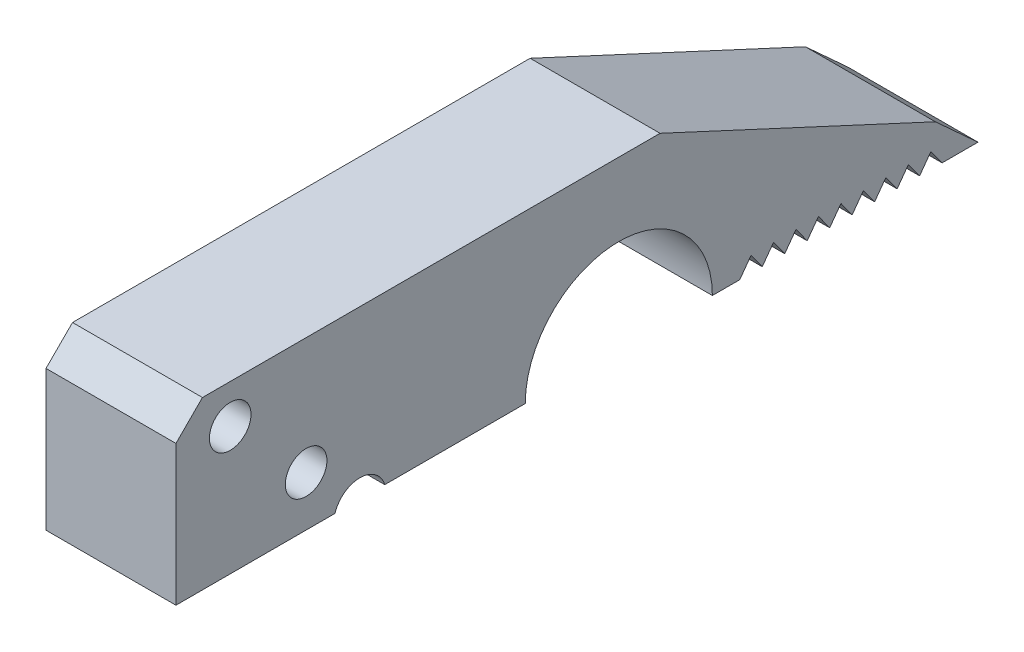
ISO-10303-21;
HEADER;
FILE_DESCRIPTION(('STEP AP214'),'2;1');
FILE_NAME('part.step','',(''),(''),'','','');
FILE_SCHEMA(('AUTOMOTIVE_DESIGN { 1 0 10303 214 1 1 1 1 }'));
ENDSEC;
DATA;
#1=APPLICATION_CONTEXT('core data for automotive mechanical design processes');
#2=APPLICATION_PROTOCOL_DEFINITION('international standard','automotive_design',2000,#1);
#3=PRODUCT_CONTEXT('',#1,'mechanical');
#4=PRODUCT('Part','Part','',(#3));
#5=PRODUCT_RELATED_PRODUCT_CATEGORY('part','',(#4));
#6=PRODUCT_DEFINITION_FORMATION('','',#4);
#7=PRODUCT_DEFINITION_CONTEXT('part definition',#1,'design');
#8=PRODUCT_DEFINITION('design','',#6,#7);
#9=PRODUCT_DEFINITION_SHAPE('','',#8);
#10=(LENGTH_UNIT() NAMED_UNIT(*) SI_UNIT(.MILLI.,.METRE.));
#11=(NAMED_UNIT(*) PLANE_ANGLE_UNIT() SI_UNIT($,.RADIAN.));
#12=(NAMED_UNIT(*) SI_UNIT($,.STERADIAN.) SOLID_ANGLE_UNIT());
#13=UNCERTAINTY_MEASURE_WITH_UNIT(LENGTH_MEASURE(1.E-05),#10,'distance_accuracy_value','');
#14=(GEOMETRIC_REPRESENTATION_CONTEXT(3) GLOBAL_UNCERTAINTY_ASSIGNED_CONTEXT((#13)) GLOBAL_UNIT_ASSIGNED_CONTEXT((#10,
#11,#12)) REPRESENTATION_CONTEXT('',''));
#15=CARTESIAN_POINT('',(0.,0.,0.));
#16=DIRECTION('',(0.,0.,1.));
#17=DIRECTION('',(1.,0.,0.));
#18=AXIS2_PLACEMENT_3D('',#15,#16,#17);
#19=CARTESIAN_POINT('',(10.,-1.98943737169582,-3.36560939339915));
#20=DIRECTION('',(-1.,0.,0.));
#21=DIRECTION('',(0.,0.,1.));
#22=AXIS2_PLACEMENT_3D('',#19,#20,#21);
#23=PLANE('',#22);
#24=DIRECTION('',(0.,0.,-1.));
#25=VECTOR('',#24,1.);
#26=CARTESIAN_POINT('',(10.,-1.40674556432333,10.7902319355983));
#27=LINE('',#26,#25);
#28=CARTESIAN_POINT('',(10.,-1.40674556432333,10.7902319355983));
#29=VERTEX_POINT('',#28);
#30=CARTESIAN_POINT('',(10.,-1.40674556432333,-1.45237384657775));
#31=VERTEX_POINT('',#30);
#32=EDGE_CURVE('E323',#29,#31,#27,.T.);
#33=ORIENTED_EDGE('',*,*,#32,.T.);
#34=CARTESIAN_POINT('',(10.,-1.98943737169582,-3.36560939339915));
#35=DIRECTION('',(-1.,0.,0.));
#36=DIRECTION('',(0.,0.,1.));
#37=AXIS2_PLACEMENT_3D('',#34,#35,#36);
#38=CIRCLE('',#37,2.);
#39=CARTESIAN_POINT('',(10.,-1.40674556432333,-5.27884494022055));
#40=VERTEX_POINT('',#39);
#41=EDGE_CURVE('E166',#31,#40,#38,.T.);
#42=ORIENTED_EDGE('',*,*,#41,.T.);
#43=DIRECTION('',(0.,0.,-1.));
#44=VECTOR('',#43,1.);
#45=CARTESIAN_POINT('',(10.,-1.40674556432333,-5.27884494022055));
#46=LINE('',#45,#44);
#47=CARTESIAN_POINT('',(10.,-1.40674556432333,-16.0922624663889));
#48=VERTEX_POINT('',#47);
#49=EDGE_CURVE('E401',#40,#48,#46,.T.);
#50=ORIENTED_EDGE('',*,*,#49,.T.);
#51=CARTESIAN_POINT('',(10.,-1.40674556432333,-23.2922624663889));
#52=DIRECTION('',(-1.,0.,0.));
#53=DIRECTION('',(0.,0.,1.));
#54=AXIS2_PLACEMENT_3D('',#51,#52,#53);
#55=CIRCLE('',#54,7.2);
#56=CARTESIAN_POINT('',(10.,-1.40674556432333,-30.4922624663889));
#57=VERTEX_POINT('',#56);
#58=EDGE_CURVE('E420',#48,#57,#55,.T.);
#59=ORIENTED_EDGE('',*,*,#58,.T.);
#60=DIRECTION('',(0.,0.,-1.));
#61=VECTOR('',#60,1.);
#62=CARTESIAN_POINT('',(10.,-1.40674556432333,-30.4922624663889));
#63=LINE('',#62,#61);
#64=CARTESIAN_POINT('',(10.,-1.40674556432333,-32.6011015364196));
#65=VERTEX_POINT('',#64);
#66=EDGE_CURVE('E417',#57,#65,#63,.T.);
#67=ORIENTED_EDGE('',*,*,#66,.T.);
#68=DIRECTION('',(0.,0.809016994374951,-0.587785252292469));
#69=VECTOR('',#68,1.);
#70=CARTESIAN_POINT('',(10.,-1.40674556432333,-32.6011015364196));
#71=LINE('',#70,#69);
#72=CARTESIAN_POINT('',(10.,-0.216175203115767,-33.4661015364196));
#73=VERTEX_POINT('',#72);
#74=EDGE_CURVE('E419',#65,#73,#71,.T.);
#75=ORIENTED_EDGE('',*,*,#74,.T.);
#76=DIRECTION('',(0.,-0.809016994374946,-0.587785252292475));
#77=VECTOR('',#76,1.);
#78=CARTESIAN_POINT('',(10.,-0.216175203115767,-33.4661015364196));
#79=LINE('',#78,#77);
#80=CARTESIAN_POINT('',(10.,-1.40674556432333,-34.3311015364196));
#81=VERTEX_POINT('',#80);
#82=EDGE_CURVE('E422',#73,#81,#79,.T.);
#83=ORIENTED_EDGE('',*,*,#82,.T.);
#84=DIRECTION('',(0.,0.809016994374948,-0.587785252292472));
#85=VECTOR('',#84,1.);
#86=CARTESIAN_POINT('',(10.,-1.40674556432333,-34.3311015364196));
#87=LINE('',#86,#85);
#88=CARTESIAN_POINT('',(10.,-0.216175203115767,-35.1961015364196));
#89=VERTEX_POINT('',#88);
#90=EDGE_CURVE('E428',#81,#89,#87,.T.);
#91=ORIENTED_EDGE('',*,*,#90,.T.);
#92=DIRECTION('',(0.,-0.809016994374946,-0.587785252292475));
#93=VECTOR('',#92,1.);
#94=CARTESIAN_POINT('',(10.,-0.216175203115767,-35.1961015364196));
#95=LINE('',#94,#93);
#96=CARTESIAN_POINT('',(10.,-1.40674556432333,-36.0611015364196));
#97=VERTEX_POINT('',#96);
#98=EDGE_CURVE('E430',#89,#97,#95,.T.);
#99=ORIENTED_EDGE('',*,*,#98,.T.);
#100=DIRECTION('',(0.,0.809016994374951,-0.587785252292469));
#101=VECTOR('',#100,1.);
#102=CARTESIAN_POINT('',(10.,-1.40674556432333,-36.0611015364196));
#103=LINE('',#102,#101);
#104=CARTESIAN_POINT('',(10.,-0.216175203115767,-36.9261015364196));
#105=VERTEX_POINT('',#104);
#106=EDGE_CURVE('E432',#97,#105,#103,.T.);
#107=ORIENTED_EDGE('',*,*,#106,.T.);
#108=DIRECTION('',(0.,-0.809016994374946,-0.587785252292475));
#109=VECTOR('',#108,1.);
#110=CARTESIAN_POINT('',(10.,-0.216175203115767,-36.9261015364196));
#111=LINE('',#110,#109);
#112=CARTESIAN_POINT('',(10.,-1.40674556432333,-37.7911015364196));
#113=VERTEX_POINT('',#112);
#114=EDGE_CURVE('E434',#105,#113,#111,.T.);
#115=ORIENTED_EDGE('',*,*,#114,.T.);
#116=DIRECTION('',(0.,0.809016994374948,-0.587785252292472));
#117=VECTOR('',#116,1.);
#118=CARTESIAN_POINT('',(10.,-1.40674556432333,-37.7911015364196));
#119=LINE('',#118,#117);
#120=CARTESIAN_POINT('',(10.,-0.216175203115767,-38.6561015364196));
#121=VERTEX_POINT('',#120);
#122=EDGE_CURVE('E436',#113,#121,#119,.T.);
#123=ORIENTED_EDGE('',*,*,#122,.T.);
#124=DIRECTION('',(0.,-0.809016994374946,-0.587785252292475));
#125=VECTOR('',#124,1.);
#126=CARTESIAN_POINT('',(10.,-0.216175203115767,-38.6561015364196));
#127=LINE('',#126,#125);
#128=CARTESIAN_POINT('',(10.,-1.40674556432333,-39.5211015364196));
#129=VERTEX_POINT('',#128);
#130=EDGE_CURVE('E438',#121,#129,#127,.T.);
#131=ORIENTED_EDGE('',*,*,#130,.T.);
#132=DIRECTION('',(0.,0.809016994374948,-0.587785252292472));
#133=VECTOR('',#132,1.);
#134=CARTESIAN_POINT('',(10.,-1.40674556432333,-39.5211015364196));
#135=LINE('',#134,#133);
#136=CARTESIAN_POINT('',(10.,-0.216175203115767,-40.3861015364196));
#137=VERTEX_POINT('',#136);
#138=EDGE_CURVE('E440',#129,#137,#135,.T.);
#139=ORIENTED_EDGE('',*,*,#138,.T.);
#140=DIRECTION('',(0.,-0.809016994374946,-0.587785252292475));
#141=VECTOR('',#140,1.);
#142=CARTESIAN_POINT('',(10.,-0.216175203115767,-40.3861015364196));
#143=LINE('',#142,#141);
#144=CARTESIAN_POINT('',(10.,-1.40674556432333,-41.2511015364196));
#145=VERTEX_POINT('',#144);
#146=EDGE_CURVE('E442',#137,#145,#143,.T.);
#147=ORIENTED_EDGE('',*,*,#146,.T.);
#148=DIRECTION('',(0.,0.809016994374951,-0.587785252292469));
#149=VECTOR('',#148,1.);
#150=CARTESIAN_POINT('',(10.,-1.40674556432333,-41.2511015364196));
#151=LINE('',#150,#149);
#152=CARTESIAN_POINT('',(10.,-0.216175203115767,-42.1161015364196));
#153=VERTEX_POINT('',#152);
#154=EDGE_CURVE('E444',#145,#153,#151,.T.);
#155=ORIENTED_EDGE('',*,*,#154,.T.);
#156=DIRECTION('',(0.,-0.809016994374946,-0.587785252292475));
#157=VECTOR('',#156,1.);
#158=CARTESIAN_POINT('',(10.,-0.216175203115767,-42.1161015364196));
#159=LINE('',#158,#157);
#160=CARTESIAN_POINT('',(10.,-1.40674556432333,-42.9811015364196));
#161=VERTEX_POINT('',#160);
#162=EDGE_CURVE('E446',#153,#161,#159,.T.);
#163=ORIENTED_EDGE('',*,*,#162,.T.);
#164=DIRECTION('',(0.,0.809016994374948,-0.587785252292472));
#165=VECTOR('',#164,1.);
#166=CARTESIAN_POINT('',(10.,-1.40674556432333,-42.9811015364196));
#167=LINE('',#166,#165);
#168=CARTESIAN_POINT('',(10.,-0.216175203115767,-43.8461015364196));
#169=VERTEX_POINT('',#168);
#170=EDGE_CURVE('E448',#161,#169,#167,.T.);
#171=ORIENTED_EDGE('',*,*,#170,.T.);
#172=DIRECTION('',(0.,-0.809016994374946,-0.587785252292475));
#173=VECTOR('',#172,1.);
#174=CARTESIAN_POINT('',(10.,-0.216175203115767,-43.8461015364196));
#175=LINE('',#174,#173);
#176=CARTESIAN_POINT('',(10.,-1.40674556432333,-44.7111015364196));
#177=VERTEX_POINT('',#176);
#178=EDGE_CURVE('E450',#169,#177,#175,.T.);
#179=ORIENTED_EDGE('',*,*,#178,.T.);
#180=DIRECTION('',(0.,0.809016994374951,-0.587785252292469));
#181=VECTOR('',#180,1.);
#182=CARTESIAN_POINT('',(10.,-1.40674556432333,-44.7111015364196));
#183=LINE('',#182,#181);
#184=CARTESIAN_POINT('',(10.,-0.216175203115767,-45.5761015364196));
#185=VERTEX_POINT('',#184);
#186=EDGE_CURVE('E452',#177,#185,#183,.T.);
#187=ORIENTED_EDGE('',*,*,#186,.T.);
#188=DIRECTION('',(0.,-0.809016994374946,-0.587785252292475));
#189=VECTOR('',#188,1.);
#190=CARTESIAN_POINT('',(10.,-0.216175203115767,-45.5761015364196));
#191=LINE('',#190,#189);
#192=CARTESIAN_POINT('',(10.,-1.40674556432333,-46.4411015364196));
#193=VERTEX_POINT('',#192);
#194=EDGE_CURVE('E454',#185,#193,#191,.T.);
#195=ORIENTED_EDGE('',*,*,#194,.T.);
#196=DIRECTION('',(0.,0.809016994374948,-0.587785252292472));
#197=VECTOR('',#196,1.);
#198=CARTESIAN_POINT('',(10.,-1.40674556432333,-46.4411015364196));
#199=LINE('',#198,#197);
#200=CARTESIAN_POINT('',(10.,-0.216175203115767,-47.3061015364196));
#201=VERTEX_POINT('',#200);
#202=EDGE_CURVE('E456',#193,#201,#199,.T.);
#203=ORIENTED_EDGE('',*,*,#202,.T.);
#204=DIRECTION('',(0.,-0.809016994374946,-0.587785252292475));
#205=VECTOR('',#204,1.);
#206=CARTESIAN_POINT('',(10.,-0.216175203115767,-47.3061015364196));
#207=LINE('',#206,#205);
#208=CARTESIAN_POINT('',(10.,-1.40674556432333,-48.1711015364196));
#209=VERTEX_POINT('',#208);
#210=EDGE_CURVE('E458',#201,#209,#207,.T.);
#211=ORIENTED_EDGE('',*,*,#210,.T.);
#212=DIRECTION('',(0.,0.,-1.));
#213=VECTOR('',#212,1.);
#214=CARTESIAN_POINT('',(10.,-1.40674556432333,-48.1711015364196));
#215=LINE('',#214,#213);
#216=CARTESIAN_POINT('',(10.,-1.40674556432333,-50.9331652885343));
#217=VERTEX_POINT('',#216);
#218=EDGE_CURVE('E460',#209,#217,#215,.T.);
#219=ORIENTED_EDGE('',*,*,#218,.T.);
#220=DIRECTION('',(0.,0.674774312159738,0.738024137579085));
#221=VECTOR('',#220,1.);
#222=CARTESIAN_POINT('',(10.,-1.40674556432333,-50.9331652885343));
#223=LINE('',#222,#221);
#224=CARTESIAN_POINT('',(10.,1.59354352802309,-47.6516447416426));
#225=VERTEX_POINT('',#224);
#226=EDGE_CURVE('E462',#217,#225,#223,.T.);
#227=ORIENTED_EDGE('',*,*,#226,.T.);
#228=DIRECTION('',(0.,0.420711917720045,0.907194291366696));
#229=VECTOR('',#228,1.);
#230=CARTESIAN_POINT('',(10.,11.4186627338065,-26.4654323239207));
#231=LINE('',#230,#229);
#232=CARTESIAN_POINT('',(10.,11.4186627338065,-26.4654323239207));
#233=VERTEX_POINT('',#232);
#234=EDGE_CURVE('E248',#225,#233,#231,.T.);
#235=ORIENTED_EDGE('',*,*,#234,.T.);
#236=DIRECTION('',(0.,0.,1.));
#237=VECTOR('',#236,1.);
#238=CARTESIAN_POINT('',(10.,11.4186627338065,8.75025672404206));
#239=LINE('',#238,#237);
#240=CARTESIAN_POINT('',(10.,11.4186627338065,8.75025672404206));
#241=VERTEX_POINT('',#240);
#242=EDGE_CURVE('E242',#233,#241,#239,.T.);
#243=ORIENTED_EDGE('',*,*,#242,.T.);
#244=DIRECTION('',(0.,-0.707106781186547,0.707106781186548));
#245=VECTOR('',#244,1.);
#246=CARTESIAN_POINT('',(10.,11.4186627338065,8.75025672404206));
#247=LINE('',#246,#245);
#248=CARTESIAN_POINT('',(10.,9.37868752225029,10.7902319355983));
#249=VERTEX_POINT('',#248);
#250=EDGE_CURVE('E246',#241,#249,#247,.T.);
#251=ORIENTED_EDGE('',*,*,#250,.T.);
#252=DIRECTION('',(0.,-1.,0.));
#253=VECTOR('',#252,1.);
#254=CARTESIAN_POINT('',(10.,-1.40674556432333,10.7902319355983));
#255=LINE('',#254,#253);
#256=EDGE_CURVE('E60',#249,#29,#255,.T.);
#257=ORIENTED_EDGE('',*,*,#256,.T.);
#258=EDGE_LOOP('',(#33,#42,#50,#59,#67,#75,#83,#91,#99,#107,#115,#123,#131,#139,#147,#155,#163,
#171,#179,#187,#195,#203,#211,#219,#227,#235,#243,#251,#257));
#259=FACE_BOUND('',#258,.T.);
#260=CARTESIAN_POINT('',(10.,8.42980623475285,6.61369818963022));
#261=DIRECTION('',(1.,0.,0.));
#262=DIRECTION('',(0.,0.,-1.));
#263=AXIS2_PLACEMENT_3D('',#260,#261,#262);
#264=CIRCLE('',#263,1.6);
#265=CARTESIAN_POINT('',(10.,8.42980623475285,5.01369818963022));
#266=VERTEX_POINT('',#265);
#267=EDGE_CURVE('E270',#266,#266,#264,.T.);
#268=ORIENTED_EDGE('',*,*,#267,.F.);
#269=EDGE_LOOP('',(#268));
#270=FACE_BOUND('',#269,.T.);
#271=CARTESIAN_POINT('',(10.,2.43369588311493,0.772529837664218));
#272=DIRECTION('',(1.,0.,0.));
#273=DIRECTION('',(0.,0.,-1.));
#274=AXIS2_PLACEMENT_3D('',#271,#272,#273);
#275=CIRCLE('',#274,1.6);
#276=CARTESIAN_POINT('',(10.,2.43369588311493,-0.827470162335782));
#277=VERTEX_POINT('',#276);
#278=EDGE_CURVE('E503',#277,#277,#275,.T.);
#279=ORIENTED_EDGE('',*,*,#278,.F.);
#280=EDGE_LOOP('',(#279));
#281=FACE_BOUND('',#280,.T.);
#282=ADVANCED_FACE('F43',(#259,#270,#281),#23,.F.);
#283=CARTESIAN_POINT('',(0.,-1.98943737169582,-3.36560939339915));
#284=DIRECTION('',(-1.,0.,0.));
#285=DIRECTION('',(0.,0.,1.));
#286=AXIS2_PLACEMENT_3D('',#283,#284,#285);
#287=PLANE('',#286);
#288=CARTESIAN_POINT('',(0.,8.42980623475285,6.61369818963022));
#289=DIRECTION('',(1.,0.,0.));
#290=DIRECTION('',(0.,0.,-1.));
#291=AXIS2_PLACEMENT_3D('',#288,#289,#290);
#292=CIRCLE('',#291,1.6);
#293=CARTESIAN_POINT('',(0.,8.42980623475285,5.01369818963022));
#294=VERTEX_POINT('',#293);
#295=EDGE_CURVE('E508',#294,#294,#292,.T.);
#296=ORIENTED_EDGE('',*,*,#295,.T.);
#297=EDGE_LOOP('',(#296));
#298=FACE_BOUND('',#297,.T.);
#299=DIRECTION('',(0.,0.,-1.));
#300=VECTOR('',#299,1.);
#301=CARTESIAN_POINT('',(0.,-1.40674556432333,10.7902319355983));
#302=LINE('',#301,#300);
#303=CARTESIAN_POINT('',(0.,-1.40674556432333,10.7902319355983));
#304=VERTEX_POINT('',#303);
#305=CARTESIAN_POINT('',(0.,-1.40674556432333,-1.45237384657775));
#306=VERTEX_POINT('',#305);
#307=EDGE_CURVE('E266',#304,#306,#302,.T.);
#308=ORIENTED_EDGE('',*,*,#307,.F.);
#309=DIRECTION('',(0.,-1.,0.));
#310=VECTOR('',#309,1.);
#311=CARTESIAN_POINT('',(0.,-1.40674556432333,10.7902319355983));
#312=LINE('',#311,#310);
#313=CARTESIAN_POINT('',(0.,9.37868752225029,10.7902319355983));
#314=VERTEX_POINT('',#313);
#315=EDGE_CURVE('E158',#314,#304,#312,.T.);
#316=ORIENTED_EDGE('',*,*,#315,.F.);
#317=DIRECTION('',(0.,-0.707106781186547,0.707106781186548));
#318=VECTOR('',#317,1.);
#319=CARTESIAN_POINT('',(0.,11.4186627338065,8.75025672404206));
#320=LINE('',#319,#318);
#321=CARTESIAN_POINT('',(0.,11.4186627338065,8.75025672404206));
#322=VERTEX_POINT('',#321);
#323=EDGE_CURVE('E152',#322,#314,#320,.T.);
#324=ORIENTED_EDGE('',*,*,#323,.F.);
#325=DIRECTION('',(0.,0.,1.));
#326=VECTOR('',#325,1.);
#327=CARTESIAN_POINT('',(0.,11.4186627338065,8.75025672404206));
#328=LINE('',#327,#326);
#329=CARTESIAN_POINT('',(0.,11.4186627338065,-26.4654323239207));
#330=VERTEX_POINT('',#329);
#331=EDGE_CURVE('E256',#330,#322,#328,.T.);
#332=ORIENTED_EDGE('',*,*,#331,.F.);
#333=DIRECTION('',(0.,0.420711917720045,0.907194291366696));
#334=VECTOR('',#333,1.);
#335=CARTESIAN_POINT('',(0.,11.4186627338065,-26.4654323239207));
#336=LINE('',#335,#334);
#337=CARTESIAN_POINT('',(0.,1.59354352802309,-47.6516447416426));
#338=VERTEX_POINT('',#337);
#339=EDGE_CURVE('E318',#338,#330,#336,.T.);
#340=ORIENTED_EDGE('',*,*,#339,.F.);
#341=DIRECTION('',(0.,0.674774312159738,0.738024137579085));
#342=VECTOR('',#341,1.);
#343=CARTESIAN_POINT('',(0.,-1.40674556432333,-50.9331652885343));
#344=LINE('',#343,#342);
#345=CARTESIAN_POINT('',(0.,-1.40674556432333,-50.9331652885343));
#346=VERTEX_POINT('',#345);
#347=EDGE_CURVE('E316',#346,#338,#344,.T.);
#348=ORIENTED_EDGE('',*,*,#347,.F.);
#349=DIRECTION('',(0.,0.,-1.));
#350=VECTOR('',#349,1.);
#351=CARTESIAN_POINT('',(0.,-1.40674556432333,-48.1711015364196));
#352=LINE('',#351,#350);
#353=CARTESIAN_POINT('',(0.,-1.40674556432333,-48.1711015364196));
#354=VERTEX_POINT('',#353);
#355=EDGE_CURVE('E314',#354,#346,#352,.T.);
#356=ORIENTED_EDGE('',*,*,#355,.F.);
#357=DIRECTION('',(0.,-0.809016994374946,-0.587785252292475));
#358=VECTOR('',#357,1.);
#359=CARTESIAN_POINT('',(0.,-0.216175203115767,-47.3061015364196));
#360=LINE('',#359,#358);
#361=CARTESIAN_POINT('',(0.,-0.216175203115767,-47.3061015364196));
#362=VERTEX_POINT('',#361);
#363=EDGE_CURVE('E312',#362,#354,#360,.T.);
#364=ORIENTED_EDGE('',*,*,#363,.F.);
#365=DIRECTION('',(0.,0.809016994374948,-0.587785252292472));
#366=VECTOR('',#365,1.);
#367=CARTESIAN_POINT('',(0.,-1.40674556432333,-46.4411015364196));
#368=LINE('',#367,#366);
#369=CARTESIAN_POINT('',(0.,-1.40674556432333,-46.4411015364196));
#370=VERTEX_POINT('',#369);
#371=EDGE_CURVE('E310',#370,#362,#368,.T.);
#372=ORIENTED_EDGE('',*,*,#371,.F.);
#373=DIRECTION('',(0.,-0.809016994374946,-0.587785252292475));
#374=VECTOR('',#373,1.);
#375=CARTESIAN_POINT('',(0.,-0.216175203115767,-45.5761015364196));
#376=LINE('',#375,#374);
#377=CARTESIAN_POINT('',(0.,-0.216175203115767,-45.5761015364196));
#378=VERTEX_POINT('',#377);
#379=EDGE_CURVE('E308',#378,#370,#376,.T.);
#380=ORIENTED_EDGE('',*,*,#379,.F.);
#381=DIRECTION('',(0.,0.809016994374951,-0.587785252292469));
#382=VECTOR('',#381,1.);
#383=CARTESIAN_POINT('',(0.,-1.40674556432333,-44.7111015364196));
#384=LINE('',#383,#382);
#385=CARTESIAN_POINT('',(0.,-1.40674556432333,-44.7111015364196));
#386=VERTEX_POINT('',#385);
#387=EDGE_CURVE('E306',#386,#378,#384,.T.);
#388=ORIENTED_EDGE('',*,*,#387,.F.);
#389=DIRECTION('',(0.,-0.809016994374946,-0.587785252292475));
#390=VECTOR('',#389,1.);
#391=CARTESIAN_POINT('',(0.,-0.216175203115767,-43.8461015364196));
#392=LINE('',#391,#390);
#393=CARTESIAN_POINT('',(0.,-0.216175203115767,-43.8461015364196));
#394=VERTEX_POINT('',#393);
#395=EDGE_CURVE('E304',#394,#386,#392,.T.);
#396=ORIENTED_EDGE('',*,*,#395,.F.);
#397=DIRECTION('',(0.,0.809016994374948,-0.587785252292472));
#398=VECTOR('',#397,1.);
#399=CARTESIAN_POINT('',(0.,-1.40674556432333,-42.9811015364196));
#400=LINE('',#399,#398);
#401=CARTESIAN_POINT('',(0.,-1.40674556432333,-42.9811015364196));
#402=VERTEX_POINT('',#401);
#403=EDGE_CURVE('E302',#402,#394,#400,.T.);
#404=ORIENTED_EDGE('',*,*,#403,.F.);
#405=DIRECTION('',(0.,-0.809016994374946,-0.587785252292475));
#406=VECTOR('',#405,1.);
#407=CARTESIAN_POINT('',(0.,-0.216175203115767,-42.1161015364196));
#408=LINE('',#407,#406);
#409=CARTESIAN_POINT('',(0.,-0.216175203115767,-42.1161015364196));
#410=VERTEX_POINT('',#409);
#411=EDGE_CURVE('E300',#410,#402,#408,.T.);
#412=ORIENTED_EDGE('',*,*,#411,.F.);
#413=DIRECTION('',(0.,0.809016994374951,-0.587785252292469));
#414=VECTOR('',#413,1.);
#415=CARTESIAN_POINT('',(0.,-1.40674556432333,-41.2511015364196));
#416=LINE('',#415,#414);
#417=CARTESIAN_POINT('',(0.,-1.40674556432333,-41.2511015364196));
#418=VERTEX_POINT('',#417);
#419=EDGE_CURVE('E298',#418,#410,#416,.T.);
#420=ORIENTED_EDGE('',*,*,#419,.F.);
#421=DIRECTION('',(0.,-0.809016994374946,-0.587785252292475));
#422=VECTOR('',#421,1.);
#423=CARTESIAN_POINT('',(0.,-0.216175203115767,-40.3861015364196));
#424=LINE('',#423,#422);
#425=CARTESIAN_POINT('',(0.,-0.216175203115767,-40.3861015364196));
#426=VERTEX_POINT('',#425);
#427=EDGE_CURVE('E296',#426,#418,#424,.T.);
#428=ORIENTED_EDGE('',*,*,#427,.F.);
#429=DIRECTION('',(0.,0.809016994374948,-0.587785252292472));
#430=VECTOR('',#429,1.);
#431=CARTESIAN_POINT('',(0.,-1.40674556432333,-39.5211015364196));
#432=LINE('',#431,#430);
#433=CARTESIAN_POINT('',(0.,-1.40674556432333,-39.5211015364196));
#434=VERTEX_POINT('',#433);
#435=EDGE_CURVE('E294',#434,#426,#432,.T.);
#436=ORIENTED_EDGE('',*,*,#435,.F.);
#437=DIRECTION('',(0.,-0.809016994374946,-0.587785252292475));
#438=VECTOR('',#437,1.);
#439=CARTESIAN_POINT('',(0.,-0.216175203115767,-38.6561015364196));
#440=LINE('',#439,#438);
#441=CARTESIAN_POINT('',(0.,-0.216175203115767,-38.6561015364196));
#442=VERTEX_POINT('',#441);
#443=EDGE_CURVE('E292',#442,#434,#440,.T.);
#444=ORIENTED_EDGE('',*,*,#443,.F.);
#445=DIRECTION('',(0.,0.809016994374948,-0.587785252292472));
#446=VECTOR('',#445,1.);
#447=CARTESIAN_POINT('',(0.,-1.40674556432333,-37.7911015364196));
#448=LINE('',#447,#446);
#449=CARTESIAN_POINT('',(0.,-1.40674556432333,-37.7911015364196));
#450=VERTEX_POINT('',#449);
#451=EDGE_CURVE('E290',#450,#442,#448,.T.);
#452=ORIENTED_EDGE('',*,*,#451,.F.);
#453=DIRECTION('',(0.,-0.809016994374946,-0.587785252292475));
#454=VECTOR('',#453,1.);
#455=CARTESIAN_POINT('',(0.,-0.216175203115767,-36.9261015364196));
#456=LINE('',#455,#454);
#457=CARTESIAN_POINT('',(0.,-0.216175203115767,-36.9261015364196));
#458=VERTEX_POINT('',#457);
#459=EDGE_CURVE('E288',#458,#450,#456,.T.);
#460=ORIENTED_EDGE('',*,*,#459,.F.);
#461=DIRECTION('',(0.,0.809016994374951,-0.587785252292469));
#462=VECTOR('',#461,1.);
#463=CARTESIAN_POINT('',(0.,-1.40674556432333,-36.0611015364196));
#464=LINE('',#463,#462);
#465=CARTESIAN_POINT('',(0.,-1.40674556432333,-36.0611015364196));
#466=VERTEX_POINT('',#465);
#467=EDGE_CURVE('E286',#466,#458,#464,.T.);
#468=ORIENTED_EDGE('',*,*,#467,.F.);
#469=DIRECTION('',(0.,-0.809016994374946,-0.587785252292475));
#470=VECTOR('',#469,1.);
#471=CARTESIAN_POINT('',(0.,-0.216175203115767,-35.1961015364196));
#472=LINE('',#471,#470);
#473=CARTESIAN_POINT('',(0.,-0.216175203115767,-35.1961015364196));
#474=VERTEX_POINT('',#473);
#475=EDGE_CURVE('E284',#474,#466,#472,.T.);
#476=ORIENTED_EDGE('',*,*,#475,.F.);
#477=DIRECTION('',(0.,0.809016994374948,-0.587785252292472));
#478=VECTOR('',#477,1.);
#479=CARTESIAN_POINT('',(0.,-1.40674556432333,-34.3311015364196));
#480=LINE('',#479,#478);
#481=CARTESIAN_POINT('',(0.,-1.40674556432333,-34.3311015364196));
#482=VERTEX_POINT('',#481);
#483=EDGE_CURVE('E282',#482,#474,#480,.T.);
#484=ORIENTED_EDGE('',*,*,#483,.F.);
#485=DIRECTION('',(0.,-0.809016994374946,-0.587785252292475));
#486=VECTOR('',#485,1.);
#487=CARTESIAN_POINT('',(0.,-0.216175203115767,-33.4661015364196));
#488=LINE('',#487,#486);
#489=CARTESIAN_POINT('',(0.,-0.216175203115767,-33.4661015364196));
#490=VERTEX_POINT('',#489);
#491=EDGE_CURVE('E280',#490,#482,#488,.T.);
#492=ORIENTED_EDGE('',*,*,#491,.F.);
#493=DIRECTION('',(0.,0.809016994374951,-0.587785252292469));
#494=VECTOR('',#493,1.);
#495=CARTESIAN_POINT('',(0.,-1.40674556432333,-32.6011015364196));
#496=LINE('',#495,#494);
#497=CARTESIAN_POINT('',(0.,-1.40674556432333,-32.6011015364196));
#498=VERTEX_POINT('',#497);
#499=EDGE_CURVE('E278',#498,#490,#496,.T.);
#500=ORIENTED_EDGE('',*,*,#499,.F.);
#501=DIRECTION('',(0.,0.,-1.));
#502=VECTOR('',#501,1.);
#503=CARTESIAN_POINT('',(0.,-1.40674556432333,-30.4922624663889));
#504=LINE('',#503,#502);
#505=CARTESIAN_POINT('',(0.,-1.40674556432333,-30.4922624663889));
#506=VERTEX_POINT('',#505);
#507=EDGE_CURVE('E276',#506,#498,#504,.T.);
#508=ORIENTED_EDGE('',*,*,#507,.F.);
#509=CARTESIAN_POINT('',(0.,-1.40674556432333,-23.2922624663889));
#510=DIRECTION('',(-1.,0.,0.));
#511=DIRECTION('',(0.,0.,1.));
#512=AXIS2_PLACEMENT_3D('',#509,#510,#511);
#513=CIRCLE('',#512,7.2);
#514=CARTESIAN_POINT('',(0.,-1.40674556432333,-16.0922624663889));
#515=VERTEX_POINT('',#514);
#516=EDGE_CURVE('E274',#515,#506,#513,.T.);
#517=ORIENTED_EDGE('',*,*,#516,.F.);
#518=DIRECTION('',(0.,0.,-1.));
#519=VECTOR('',#518,1.);
#520=CARTESIAN_POINT('',(0.,-1.40674556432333,-5.27884494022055));
#521=LINE('',#520,#519);
#522=CARTESIAN_POINT('',(0.,-1.40674556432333,-5.27884494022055));
#523=VERTEX_POINT('',#522);
#524=EDGE_CURVE('E272',#523,#515,#521,.T.);
#525=ORIENTED_EDGE('',*,*,#524,.F.);
#526=CARTESIAN_POINT('',(0.,-1.98943737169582,-3.36560939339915));
#527=DIRECTION('',(-1.,0.,0.));
#528=DIRECTION('',(0.,0.,1.));
#529=AXIS2_PLACEMENT_3D('',#526,#527,#528);
#530=CIRCLE('',#529,2.);
#531=EDGE_CURVE('E269',#306,#523,#530,.T.);
#532=ORIENTED_EDGE('',*,*,#531,.F.);
#533=EDGE_LOOP('',(#308,#316,#324,#332,#340,#348,#356,#364,#372,#380,#388,#396,#404,#412,#420,
#428,#436,#444,#452,#460,#468,#476,#484,#492,#500,#508,#517,#525,#532));
#534=FACE_BOUND('',#533,.T.);
#535=CARTESIAN_POINT('',(0.,2.43369588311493,0.772529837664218));
#536=DIRECTION('',(1.,0.,0.));
#537=DIRECTION('',(0.,0.,-1.));
#538=AXIS2_PLACEMENT_3D('',#535,#536,#537);
#539=CIRCLE('',#538,1.6);
#540=CARTESIAN_POINT('',(0.,2.43369588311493,-0.827470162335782));
#541=VERTEX_POINT('',#540);
#542=EDGE_CURVE('E506',#541,#541,#539,.T.);
#543=ORIENTED_EDGE('',*,*,#542,.T.);
#544=EDGE_LOOP('',(#543));
#545=FACE_BOUND('',#544,.T.);
#546=ADVANCED_FACE('F405',(#298,#534,#545),#287,.T.);
#547=CARTESIAN_POINT('',(10.,-1.40674556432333,10.7902319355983));
#548=DIRECTION('',(0.,1.,0.));
#549=DIRECTION('',(0.,0.,1.));
#550=AXIS2_PLACEMENT_3D('',#547,#548,#549);
#551=PLANE('',#550);
#552=ORIENTED_EDGE('',*,*,#307,.T.);
#553=DIRECTION('',(-1.,0.,0.));
#554=VECTOR('',#553,1.);
#555=CARTESIAN_POINT('',(10.,-1.40674556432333,-1.45237384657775));
#556=LINE('',#555,#554);
#557=EDGE_CURVE('E11',#31,#306,#556,.T.);
#558=ORIENTED_EDGE('',*,*,#557,.F.);
#559=ORIENTED_EDGE('',*,*,#32,.F.);
#560=DIRECTION('',(-1.,0.,0.));
#561=VECTOR('',#560,1.);
#562=CARTESIAN_POINT('',(10.,-1.40674556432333,10.7902319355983));
#563=LINE('',#562,#561);
#564=EDGE_CURVE('E262',#29,#304,#563,.T.);
#565=ORIENTED_EDGE('',*,*,#564,.T.);
#566=EDGE_LOOP('',(#552,#558,#559,#565));
#567=FACE_BOUND('',#566,.T.);
#568=ADVANCED_FACE('F45',(#567),#551,.F.);
#569=CARTESIAN_POINT('',(10.,-1.98943737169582,-3.36560939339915));
#570=DIRECTION('',(-1.,0.,0.));
#571=DIRECTION('',(0.,0.,1.));
#572=AXIS2_PLACEMENT_3D('',#569,#570,#571);
#573=CYLINDRICAL_SURFACE('',#572,2.);
#574=ORIENTED_EDGE('',*,*,#531,.T.);
#575=DIRECTION('',(-1.,0.,0.));
#576=VECTOR('',#575,1.);
#577=CARTESIAN_POINT('',(10.,-1.40674556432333,-5.27884494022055));
#578=LINE('',#577,#576);
#579=EDGE_CURVE('E52',#40,#523,#578,.T.);
#580=ORIENTED_EDGE('',*,*,#579,.F.);
#581=ORIENTED_EDGE('',*,*,#41,.F.);
#582=ORIENTED_EDGE('',*,*,#557,.T.);
#583=EDGE_LOOP('',(#574,#580,#581,#582));
#584=FACE_BOUND('',#583,.T.);
#585=ADVANCED_FACE('F775',(#584),#573,.F.);
#586=CARTESIAN_POINT('',(10.,-1.40674556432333,-5.27884494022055));
#587=DIRECTION('',(0.,1.,0.));
#588=DIRECTION('',(0.,0.,1.));
#589=AXIS2_PLACEMENT_3D('',#586,#587,#588);
#590=PLANE('',#589);
#591=ORIENTED_EDGE('',*,*,#524,.T.);
#592=DIRECTION('',(-1.,0.,0.));
#593=VECTOR('',#592,1.);
#594=CARTESIAN_POINT('',(10.,-1.40674556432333,-16.0922624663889));
#595=LINE('',#594,#593);
#596=EDGE_CURVE('E393',#48,#515,#595,.T.);
#597=ORIENTED_EDGE('',*,*,#596,.F.);
#598=ORIENTED_EDGE('',*,*,#49,.F.);
#599=ORIENTED_EDGE('',*,*,#579,.T.);
#600=EDGE_LOOP('',(#591,#597,#598,#599));
#601=FACE_BOUND('',#600,.T.);
#602=ADVANCED_FACE('F399',(#601),#590,.F.);
#603=CARTESIAN_POINT('',(10.,-1.40674556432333,-23.2922624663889));
#604=DIRECTION('',(-1.,0.,0.));
#605=DIRECTION('',(0.,0.,1.));
#606=AXIS2_PLACEMENT_3D('',#603,#604,#605);
#607=CYLINDRICAL_SURFACE('',#606,7.2);
#608=ORIENTED_EDGE('',*,*,#516,.T.);
#609=DIRECTION('',(-1.,0.,0.));
#610=VECTOR('',#609,1.);
#611=CARTESIAN_POINT('',(10.,-1.40674556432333,-30.4922624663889));
#612=LINE('',#611,#610);
#613=EDGE_CURVE('E390',#57,#506,#612,.T.);
#614=ORIENTED_EDGE('',*,*,#613,.F.);
#615=ORIENTED_EDGE('',*,*,#58,.F.);
#616=ORIENTED_EDGE('',*,*,#596,.T.);
#617=EDGE_LOOP('',(#608,#614,#615,#616));
#618=FACE_BOUND('',#617,.T.);
#619=ADVANCED_FACE('F411',(#618),#607,.F.);
#620=CARTESIAN_POINT('',(10.,-1.40674556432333,-30.4922624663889));
#621=DIRECTION('',(0.,1.,0.));
#622=DIRECTION('',(0.,0.,1.));
#623=AXIS2_PLACEMENT_3D('',#620,#621,#622);
#624=PLANE('',#623);
#625=ORIENTED_EDGE('',*,*,#507,.T.);
#626=DIRECTION('',(-1.,0.,0.));
#627=VECTOR('',#626,1.);
#628=CARTESIAN_POINT('',(10.,-1.40674556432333,-32.6011015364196));
#629=LINE('',#628,#627);
#630=EDGE_CURVE('E387',#65,#498,#629,.T.);
#631=ORIENTED_EDGE('',*,*,#630,.F.);
#632=ORIENTED_EDGE('',*,*,#66,.F.);
#633=ORIENTED_EDGE('',*,*,#613,.T.);
#634=EDGE_LOOP('',(#625,#631,#632,#633));
#635=FACE_BOUND('',#634,.T.);
#636=ADVANCED_FACE('F415',(#635),#624,.F.);
#637=CARTESIAN_POINT('',(10.,-1.40674556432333,-32.6011015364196));
#638=DIRECTION('',(0.,0.587785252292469,0.809016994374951));
#639=DIRECTION('',(0.,-0.809016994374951,0.587785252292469));
#640=AXIS2_PLACEMENT_3D('',#637,#638,#639);
#641=PLANE('',#640);
#642=ORIENTED_EDGE('',*,*,#499,.T.);
#643=DIRECTION('',(-1.,0.,0.));
#644=VECTOR('',#643,1.);
#645=CARTESIAN_POINT('',(10.,-0.216175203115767,-33.4661015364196));
#646=LINE('',#645,#644);
#647=EDGE_CURVE('E384',#73,#490,#646,.T.);
#648=ORIENTED_EDGE('',*,*,#647,.F.);
#649=ORIENTED_EDGE('',*,*,#74,.F.);
#650=ORIENTED_EDGE('',*,*,#630,.T.);
#651=EDGE_LOOP('',(#642,#648,#649,#650));
#652=FACE_BOUND('',#651,.T.);
#653=ADVANCED_FACE('F740',(#652),#641,.F.);
#654=CARTESIAN_POINT('',(10.,-0.216175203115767,-33.4661015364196));
#655=DIRECTION('',(0.,0.587785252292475,-0.809016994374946));
#656=DIRECTION('',(0.,0.809016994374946,0.587785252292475));
#657=AXIS2_PLACEMENT_3D('',#654,#655,#656);
#658=PLANE('',#657);
#659=ORIENTED_EDGE('',*,*,#491,.T.);
#660=DIRECTION('',(-1.,0.,0.));
#661=VECTOR('',#660,1.);
#662=CARTESIAN_POINT('',(10.,-1.40674556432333,-34.3311015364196));
#663=LINE('',#662,#661);
#664=EDGE_CURVE('E381',#81,#482,#663,.T.);
#665=ORIENTED_EDGE('',*,*,#664,.F.);
#666=ORIENTED_EDGE('',*,*,#82,.F.);
#667=ORIENTED_EDGE('',*,*,#647,.T.);
#668=EDGE_LOOP('',(#659,#665,#666,#667));
#669=FACE_BOUND('',#668,.T.);
#670=ADVANCED_FACE('F730',(#669),#658,.F.);
#671=CARTESIAN_POINT('',(10.,-1.40674556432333,-34.3311015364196));
#672=DIRECTION('',(0.,0.587785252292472,0.809016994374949));
#673=DIRECTION('',(0.,-0.809016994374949,0.587785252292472));
#674=AXIS2_PLACEMENT_3D('',#671,#672,#673);
#675=PLANE('',#674);
#676=ORIENTED_EDGE('',*,*,#483,.T.);
#677=DIRECTION('',(-1.,0.,0.));
#678=VECTOR('',#677,1.);
#679=CARTESIAN_POINT('',(10.,-0.216175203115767,-35.1961015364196));
#680=LINE('',#679,#678);
#681=EDGE_CURVE('E378',#89,#474,#680,.T.);
#682=ORIENTED_EDGE('',*,*,#681,.F.);
#683=ORIENTED_EDGE('',*,*,#90,.F.);
#684=ORIENTED_EDGE('',*,*,#664,.T.);
#685=EDGE_LOOP('',(#676,#682,#683,#684));
#686=FACE_BOUND('',#685,.T.);
#687=ADVANCED_FACE('F720',(#686),#675,.F.);
#688=CARTESIAN_POINT('',(10.,-0.216175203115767,-35.1961015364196));
#689=DIRECTION('',(0.,0.587785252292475,-0.809016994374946));
#690=DIRECTION('',(0.,0.809016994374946,0.587785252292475));
#691=AXIS2_PLACEMENT_3D('',#688,#689,#690);
#692=PLANE('',#691);
#693=ORIENTED_EDGE('',*,*,#475,.T.);
#694=DIRECTION('',(-1.,0.,0.));
#695=VECTOR('',#694,1.);
#696=CARTESIAN_POINT('',(10.,-1.40674556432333,-36.0611015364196));
#697=LINE('',#696,#695);
#698=EDGE_CURVE('E375',#97,#466,#697,.T.);
#699=ORIENTED_EDGE('',*,*,#698,.F.);
#700=ORIENTED_EDGE('',*,*,#98,.F.);
#701=ORIENTED_EDGE('',*,*,#681,.T.);
#702=EDGE_LOOP('',(#693,#699,#700,#701));
#703=FACE_BOUND('',#702,.T.);
#704=ADVANCED_FACE('F710',(#703),#692,.F.);
#705=CARTESIAN_POINT('',(10.,-1.40674556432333,-36.0611015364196));
#706=DIRECTION('',(0.,0.587785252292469,0.809016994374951));
#707=DIRECTION('',(0.,-0.809016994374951,0.587785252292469));
#708=AXIS2_PLACEMENT_3D('',#705,#706,#707);
#709=PLANE('',#708);
#710=ORIENTED_EDGE('',*,*,#467,.T.);
#711=DIRECTION('',(-1.,0.,0.));
#712=VECTOR('',#711,1.);
#713=CARTESIAN_POINT('',(10.,-0.216175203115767,-36.9261015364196));
#714=LINE('',#713,#712);
#715=EDGE_CURVE('E372',#105,#458,#714,.T.);
#716=ORIENTED_EDGE('',*,*,#715,.F.);
#717=ORIENTED_EDGE('',*,*,#106,.F.);
#718=ORIENTED_EDGE('',*,*,#698,.T.);
#719=EDGE_LOOP('',(#710,#716,#717,#718));
#720=FACE_BOUND('',#719,.T.);
#721=ADVANCED_FACE('F700',(#720),#709,.F.);
#722=CARTESIAN_POINT('',(10.,-0.216175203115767,-36.9261015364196));
#723=DIRECTION('',(0.,0.587785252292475,-0.809016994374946));
#724=DIRECTION('',(0.,0.809016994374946,0.587785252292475));
#725=AXIS2_PLACEMENT_3D('',#722,#723,#724);
#726=PLANE('',#725);
#727=ORIENTED_EDGE('',*,*,#459,.T.);
#728=DIRECTION('',(-1.,0.,0.));
#729=VECTOR('',#728,1.);
#730=CARTESIAN_POINT('',(10.,-1.40674556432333,-37.7911015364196));
#731=LINE('',#730,#729);
#732=EDGE_CURVE('E369',#113,#450,#731,.T.);
#733=ORIENTED_EDGE('',*,*,#732,.F.);
#734=ORIENTED_EDGE('',*,*,#114,.F.);
#735=ORIENTED_EDGE('',*,*,#715,.T.);
#736=EDGE_LOOP('',(#727,#733,#734,#735));
#737=FACE_BOUND('',#736,.T.);
#738=ADVANCED_FACE('F690',(#737),#726,.F.);
#739=CARTESIAN_POINT('',(10.,-1.40674556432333,-37.7911015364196));
#740=DIRECTION('',(0.,0.587785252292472,0.809016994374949));
#741=DIRECTION('',(0.,-0.809016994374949,0.587785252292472));
#742=AXIS2_PLACEMENT_3D('',#739,#740,#741);
#743=PLANE('',#742);
#744=ORIENTED_EDGE('',*,*,#451,.T.);
#745=DIRECTION('',(-1.,0.,0.));
#746=VECTOR('',#745,1.);
#747=CARTESIAN_POINT('',(10.,-0.216175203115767,-38.6561015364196));
#748=LINE('',#747,#746);
#749=EDGE_CURVE('E366',#121,#442,#748,.T.);
#750=ORIENTED_EDGE('',*,*,#749,.F.);
#751=ORIENTED_EDGE('',*,*,#122,.F.);
#752=ORIENTED_EDGE('',*,*,#732,.T.);
#753=EDGE_LOOP('',(#744,#750,#751,#752));
#754=FACE_BOUND('',#753,.T.);
#755=ADVANCED_FACE('F680',(#754),#743,.F.);
#756=CARTESIAN_POINT('',(10.,-0.216175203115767,-38.6561015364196));
#757=DIRECTION('',(0.,0.587785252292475,-0.809016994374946));
#758=DIRECTION('',(0.,0.809016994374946,0.587785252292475));
#759=AXIS2_PLACEMENT_3D('',#756,#757,#758);
#760=PLANE('',#759);
#761=ORIENTED_EDGE('',*,*,#443,.T.);
#762=DIRECTION('',(-1.,0.,0.));
#763=VECTOR('',#762,1.);
#764=CARTESIAN_POINT('',(10.,-1.40674556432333,-39.5211015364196));
#765=LINE('',#764,#763);
#766=EDGE_CURVE('E363',#129,#434,#765,.T.);
#767=ORIENTED_EDGE('',*,*,#766,.F.);
#768=ORIENTED_EDGE('',*,*,#130,.F.);
#769=ORIENTED_EDGE('',*,*,#749,.T.);
#770=EDGE_LOOP('',(#761,#767,#768,#769));
#771=FACE_BOUND('',#770,.T.);
#772=ADVANCED_FACE('F670',(#771),#760,.F.);
#773=CARTESIAN_POINT('',(10.,-1.40674556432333,-39.5211015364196));
#774=DIRECTION('',(0.,0.587785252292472,0.809016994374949));
#775=DIRECTION('',(0.,-0.809016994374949,0.587785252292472));
#776=AXIS2_PLACEMENT_3D('',#773,#774,#775);
#777=PLANE('',#776);
#778=ORIENTED_EDGE('',*,*,#435,.T.);
#779=DIRECTION('',(-1.,0.,0.));
#780=VECTOR('',#779,1.);
#781=CARTESIAN_POINT('',(10.,-0.216175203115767,-40.3861015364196));
#782=LINE('',#781,#780);
#783=EDGE_CURVE('E360',#137,#426,#782,.T.);
#784=ORIENTED_EDGE('',*,*,#783,.F.);
#785=ORIENTED_EDGE('',*,*,#138,.F.);
#786=ORIENTED_EDGE('',*,*,#766,.T.);
#787=EDGE_LOOP('',(#778,#784,#785,#786));
#788=FACE_BOUND('',#787,.T.);
#789=ADVANCED_FACE('F660',(#788),#777,.F.);
#790=CARTESIAN_POINT('',(10.,-0.216175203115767,-40.3861015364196));
#791=DIRECTION('',(0.,0.587785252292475,-0.809016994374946));
#792=DIRECTION('',(0.,0.809016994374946,0.587785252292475));
#793=AXIS2_PLACEMENT_3D('',#790,#791,#792);
#794=PLANE('',#793);
#795=ORIENTED_EDGE('',*,*,#427,.T.);
#796=DIRECTION('',(-1.,0.,0.));
#797=VECTOR('',#796,1.);
#798=CARTESIAN_POINT('',(10.,-1.40674556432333,-41.2511015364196));
#799=LINE('',#798,#797);
#800=EDGE_CURVE('E357',#145,#418,#799,.T.);
#801=ORIENTED_EDGE('',*,*,#800,.F.);
#802=ORIENTED_EDGE('',*,*,#146,.F.);
#803=ORIENTED_EDGE('',*,*,#783,.T.);
#804=EDGE_LOOP('',(#795,#801,#802,#803));
#805=FACE_BOUND('',#804,.T.);
#806=ADVANCED_FACE('F650',(#805),#794,.F.);
#807=CARTESIAN_POINT('',(10.,-1.40674556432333,-41.2511015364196));
#808=DIRECTION('',(0.,0.587785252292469,0.809016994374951));
#809=DIRECTION('',(0.,-0.809016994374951,0.587785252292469));
#810=AXIS2_PLACEMENT_3D('',#807,#808,#809);
#811=PLANE('',#810);
#812=ORIENTED_EDGE('',*,*,#419,.T.);
#813=DIRECTION('',(-1.,0.,0.));
#814=VECTOR('',#813,1.);
#815=CARTESIAN_POINT('',(10.,-0.216175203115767,-42.1161015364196));
#816=LINE('',#815,#814);
#817=EDGE_CURVE('E354',#153,#410,#816,.T.);
#818=ORIENTED_EDGE('',*,*,#817,.F.);
#819=ORIENTED_EDGE('',*,*,#154,.F.);
#820=ORIENTED_EDGE('',*,*,#800,.T.);
#821=EDGE_LOOP('',(#812,#818,#819,#820));
#822=FACE_BOUND('',#821,.T.);
#823=ADVANCED_FACE('F640',(#822),#811,.F.);
#824=CARTESIAN_POINT('',(10.,-0.216175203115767,-42.1161015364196));
#825=DIRECTION('',(0.,0.587785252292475,-0.809016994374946));
#826=DIRECTION('',(0.,0.809016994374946,0.587785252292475));
#827=AXIS2_PLACEMENT_3D('',#824,#825,#826);
#828=PLANE('',#827);
#829=ORIENTED_EDGE('',*,*,#411,.T.);
#830=DIRECTION('',(-1.,0.,0.));
#831=VECTOR('',#830,1.);
#832=CARTESIAN_POINT('',(10.,-1.40674556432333,-42.9811015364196));
#833=LINE('',#832,#831);
#834=EDGE_CURVE('E351',#161,#402,#833,.T.);
#835=ORIENTED_EDGE('',*,*,#834,.F.);
#836=ORIENTED_EDGE('',*,*,#162,.F.);
#837=ORIENTED_EDGE('',*,*,#817,.T.);
#838=EDGE_LOOP('',(#829,#835,#836,#837));
#839=FACE_BOUND('',#838,.T.);
#840=ADVANCED_FACE('F630',(#839),#828,.F.);
#841=CARTESIAN_POINT('',(10.,-1.40674556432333,-42.9811015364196));
#842=DIRECTION('',(0.,0.587785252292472,0.809016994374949));
#843=DIRECTION('',(0.,-0.809016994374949,0.587785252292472));
#844=AXIS2_PLACEMENT_3D('',#841,#842,#843);
#845=PLANE('',#844);
#846=ORIENTED_EDGE('',*,*,#403,.T.);
#847=DIRECTION('',(-1.,0.,0.));
#848=VECTOR('',#847,1.);
#849=CARTESIAN_POINT('',(10.,-0.216175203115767,-43.8461015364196));
#850=LINE('',#849,#848);
#851=EDGE_CURVE('E348',#169,#394,#850,.T.);
#852=ORIENTED_EDGE('',*,*,#851,.F.);
#853=ORIENTED_EDGE('',*,*,#170,.F.);
#854=ORIENTED_EDGE('',*,*,#834,.T.);
#855=EDGE_LOOP('',(#846,#852,#853,#854));
#856=FACE_BOUND('',#855,.T.);
#857=ADVANCED_FACE('F620',(#856),#845,.F.);
#858=CARTESIAN_POINT('',(10.,-0.216175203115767,-43.8461015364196));
#859=DIRECTION('',(0.,0.587785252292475,-0.809016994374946));
#860=DIRECTION('',(0.,0.809016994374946,0.587785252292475));
#861=AXIS2_PLACEMENT_3D('',#858,#859,#860);
#862=PLANE('',#861);
#863=ORIENTED_EDGE('',*,*,#395,.T.);
#864=DIRECTION('',(-1.,0.,0.));
#865=VECTOR('',#864,1.);
#866=CARTESIAN_POINT('',(10.,-1.40674556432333,-44.7111015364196));
#867=LINE('',#866,#865);
#868=EDGE_CURVE('E345',#177,#386,#867,.T.);
#869=ORIENTED_EDGE('',*,*,#868,.F.);
#870=ORIENTED_EDGE('',*,*,#178,.F.);
#871=ORIENTED_EDGE('',*,*,#851,.T.);
#872=EDGE_LOOP('',(#863,#869,#870,#871));
#873=FACE_BOUND('',#872,.T.);
#874=ADVANCED_FACE('F610',(#873),#862,.F.);
#875=CARTESIAN_POINT('',(10.,-1.40674556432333,-44.7111015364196));
#876=DIRECTION('',(0.,0.587785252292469,0.809016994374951));
#877=DIRECTION('',(0.,-0.809016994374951,0.587785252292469));
#878=AXIS2_PLACEMENT_3D('',#875,#876,#877);
#879=PLANE('',#878);
#880=ORIENTED_EDGE('',*,*,#387,.T.);
#881=DIRECTION('',(-1.,0.,0.));
#882=VECTOR('',#881,1.);
#883=CARTESIAN_POINT('',(10.,-0.216175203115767,-45.5761015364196));
#884=LINE('',#883,#882);
#885=EDGE_CURVE('E342',#185,#378,#884,.T.);
#886=ORIENTED_EDGE('',*,*,#885,.F.);
#887=ORIENTED_EDGE('',*,*,#186,.F.);
#888=ORIENTED_EDGE('',*,*,#868,.T.);
#889=EDGE_LOOP('',(#880,#886,#887,#888));
#890=FACE_BOUND('',#889,.T.);
#891=ADVANCED_FACE('F600',(#890),#879,.F.);
#892=CARTESIAN_POINT('',(10.,-0.216175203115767,-45.5761015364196));
#893=DIRECTION('',(0.,0.587785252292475,-0.809016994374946));
#894=DIRECTION('',(0.,0.809016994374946,0.587785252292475));
#895=AXIS2_PLACEMENT_3D('',#892,#893,#894);
#896=PLANE('',#895);
#897=ORIENTED_EDGE('',*,*,#379,.T.);
#898=DIRECTION('',(-1.,0.,0.));
#899=VECTOR('',#898,1.);
#900=CARTESIAN_POINT('',(10.,-1.40674556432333,-46.4411015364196));
#901=LINE('',#900,#899);
#902=EDGE_CURVE('E339',#193,#370,#901,.T.);
#903=ORIENTED_EDGE('',*,*,#902,.F.);
#904=ORIENTED_EDGE('',*,*,#194,.F.);
#905=ORIENTED_EDGE('',*,*,#885,.T.);
#906=EDGE_LOOP('',(#897,#903,#904,#905));
#907=FACE_BOUND('',#906,.T.);
#908=ADVANCED_FACE('F590',(#907),#896,.F.);
#909=CARTESIAN_POINT('',(10.,-1.40674556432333,-46.4411015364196));
#910=DIRECTION('',(0.,0.587785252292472,0.809016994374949));
#911=DIRECTION('',(0.,-0.809016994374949,0.587785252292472));
#912=AXIS2_PLACEMENT_3D('',#909,#910,#911);
#913=PLANE('',#912);
#914=ORIENTED_EDGE('',*,*,#371,.T.);
#915=DIRECTION('',(-1.,0.,0.));
#916=VECTOR('',#915,1.);
#917=CARTESIAN_POINT('',(10.,-0.216175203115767,-47.3061015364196));
#918=LINE('',#917,#916);
#919=EDGE_CURVE('E336',#201,#362,#918,.T.);
#920=ORIENTED_EDGE('',*,*,#919,.F.);
#921=ORIENTED_EDGE('',*,*,#202,.F.);
#922=ORIENTED_EDGE('',*,*,#902,.T.);
#923=EDGE_LOOP('',(#914,#920,#921,#922));
#924=FACE_BOUND('',#923,.T.);
#925=ADVANCED_FACE('F580',(#924),#913,.F.);
#926=CARTESIAN_POINT('',(10.,-0.216175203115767,-47.3061015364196));
#927=DIRECTION('',(0.,0.587785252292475,-0.809016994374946));
#928=DIRECTION('',(0.,0.809016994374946,0.587785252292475));
#929=AXIS2_PLACEMENT_3D('',#926,#927,#928);
#930=PLANE('',#929);
#931=ORIENTED_EDGE('',*,*,#363,.T.);
#932=DIRECTION('',(-1.,0.,0.));
#933=VECTOR('',#932,1.);
#934=CARTESIAN_POINT('',(10.,-1.40674556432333,-48.1711015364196));
#935=LINE('',#934,#933);
#936=EDGE_CURVE('E333',#209,#354,#935,.T.);
#937=ORIENTED_EDGE('',*,*,#936,.F.);
#938=ORIENTED_EDGE('',*,*,#210,.F.);
#939=ORIENTED_EDGE('',*,*,#919,.T.);
#940=EDGE_LOOP('',(#931,#937,#938,#939));
#941=FACE_BOUND('',#940,.T.);
#942=ADVANCED_FACE('F570',(#941),#930,.F.);
#943=CARTESIAN_POINT('',(10.,-1.40674556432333,-48.1711015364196));
#944=DIRECTION('',(0.,1.,0.));
#945=DIRECTION('',(0.,0.,1.));
#946=AXIS2_PLACEMENT_3D('',#943,#944,#945);
#947=PLANE('',#946);
#948=ORIENTED_EDGE('',*,*,#355,.T.);
#949=DIRECTION('',(-1.,0.,0.));
#950=VECTOR('',#949,1.);
#951=CARTESIAN_POINT('',(10.,-1.40674556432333,-50.9331652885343));
#952=LINE('',#951,#950);
#953=EDGE_CURVE('E330',#217,#346,#952,.T.);
#954=ORIENTED_EDGE('',*,*,#953,.F.);
#955=ORIENTED_EDGE('',*,*,#218,.F.);
#956=ORIENTED_EDGE('',*,*,#936,.T.);
#957=EDGE_LOOP('',(#948,#954,#955,#956));
#958=FACE_BOUND('',#957,.T.);
#959=ADVANCED_FACE('F561',(#958),#947,.F.);
#960=CARTESIAN_POINT('',(10.,-1.40674556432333,-50.9331652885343));
#961=DIRECTION('',(0.,-0.738024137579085,0.674774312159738));
#962=DIRECTION('',(0.,-0.674774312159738,-0.738024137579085));
#963=AXIS2_PLACEMENT_3D('',#960,#961,#962);
#964=PLANE('',#963);
#965=ORIENTED_EDGE('',*,*,#347,.T.);
#966=DIRECTION('',(-1.,0.,0.));
#967=VECTOR('',#966,1.);
#968=CARTESIAN_POINT('',(10.,1.59354352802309,-47.6516447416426));
#969=LINE('',#968,#967);
#970=EDGE_CURVE('E327',#225,#338,#969,.T.);
#971=ORIENTED_EDGE('',*,*,#970,.F.);
#972=ORIENTED_EDGE('',*,*,#226,.F.);
#973=ORIENTED_EDGE('',*,*,#953,.T.);
#974=EDGE_LOOP('',(#965,#971,#972,#973));
#975=FACE_BOUND('',#974,.T.);
#976=ADVANCED_FACE('F468',(#975),#964,.F.);
#977=CARTESIAN_POINT('',(10.,11.4186627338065,-26.4654323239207));
#978=DIRECTION('',(0.,-0.907194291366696,0.420711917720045));
#979=DIRECTION('',(0.,-0.420711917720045,-0.907194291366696));
#980=AXIS2_PLACEMENT_3D('',#977,#978,#979);
#981=PLANE('',#980);
#982=ORIENTED_EDGE('',*,*,#339,.T.);
#983=DIRECTION('',(-1.,0.,0.));
#984=VECTOR('',#983,1.);
#985=CARTESIAN_POINT('',(10.,11.4186627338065,-26.4654323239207));
#986=LINE('',#985,#984);
#987=EDGE_CURVE('E257',#233,#330,#986,.T.);
#988=ORIENTED_EDGE('',*,*,#987,.F.);
#989=ORIENTED_EDGE('',*,*,#234,.F.);
#990=ORIENTED_EDGE('',*,*,#970,.T.);
#991=EDGE_LOOP('',(#982,#988,#989,#990));
#992=FACE_BOUND('',#991,.T.);
#993=ADVANCED_FACE('F472',(#992),#981,.F.);
#994=CARTESIAN_POINT('',(10.,11.4186627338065,8.75025672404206));
#995=DIRECTION('',(0.,-1.,0.));
#996=DIRECTION('',(0.,0.,-1.));
#997=AXIS2_PLACEMENT_3D('',#994,#995,#996);
#998=PLANE('',#997);
#999=ORIENTED_EDGE('',*,*,#331,.T.);
#1000=DIRECTION('',(-1.,0.,0.));
#1001=VECTOR('',#1000,1.);
#1002=CARTESIAN_POINT('',(10.,11.4186627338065,8.75025672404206));
#1003=LINE('',#1002,#1001);
#1004=EDGE_CURVE('E253',#241,#322,#1003,.T.);
#1005=ORIENTED_EDGE('',*,*,#1004,.F.);
#1006=ORIENTED_EDGE('',*,*,#242,.F.);
#1007=ORIENTED_EDGE('',*,*,#987,.T.);
#1008=EDGE_LOOP('',(#999,#1005,#1006,#1007));
#1009=FACE_BOUND('',#1008,.T.);
#1010=ADVANCED_FACE('F254',(#1009),#998,.F.);
#1011=CARTESIAN_POINT('',(10.,11.4186627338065,8.75025672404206));
#1012=DIRECTION('',(0.,-0.707106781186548,-0.707106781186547));
#1013=DIRECTION('',(0.,0.707106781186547,-0.707106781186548));
#1014=AXIS2_PLACEMENT_3D('',#1011,#1012,#1013);
#1015=PLANE('',#1014);
#1016=ORIENTED_EDGE('',*,*,#323,.T.);
#1017=DIRECTION('',(-1.,0.,0.));
#1018=VECTOR('',#1017,1.);
#1019=CARTESIAN_POINT('',(10.,9.37868752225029,10.7902319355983));
#1020=LINE('',#1019,#1018);
#1021=EDGE_CURVE('E258',#249,#314,#1020,.T.);
#1022=ORIENTED_EDGE('',*,*,#1021,.F.);
#1023=ORIENTED_EDGE('',*,*,#250,.F.);
#1024=ORIENTED_EDGE('',*,*,#1004,.T.);
#1025=EDGE_LOOP('',(#1016,#1022,#1023,#1024));
#1026=FACE_BOUND('',#1025,.T.);
#1027=ADVANCED_FACE('F260',(#1026),#1015,.F.);
#1028=CARTESIAN_POINT('',(10.,-1.40674556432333,10.7902319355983));
#1029=DIRECTION('',(0.,0.,-1.));
#1030=DIRECTION('',(0.,1.,0.));
#1031=AXIS2_PLACEMENT_3D('',#1028,#1029,#1030);
#1032=PLANE('',#1031);
#1033=ORIENTED_EDGE('',*,*,#315,.T.);
#1034=ORIENTED_EDGE('',*,*,#564,.F.);
#1035=ORIENTED_EDGE('',*,*,#256,.F.);
#1036=ORIENTED_EDGE('',*,*,#1021,.T.);
#1037=EDGE_LOOP('',(#1033,#1034,#1035,#1036));
#1038=FACE_BOUND('',#1037,.T.);
#1039=ADVANCED_FACE('F476',(#1038),#1032,.F.);
#1040=CARTESIAN_POINT('',(10.,8.42980623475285,6.61369818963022));
#1041=DIRECTION('',(-1.,0.,0.));
#1042=DIRECTION('',(0.,0.,1.));
#1043=AXIS2_PLACEMENT_3D('',#1040,#1041,#1042);
#1044=CYLINDRICAL_SURFACE('',#1043,1.6);
#1045=ORIENTED_EDGE('',*,*,#267,.T.);
#1046=EDGE_LOOP('',(#1045));
#1047=FACE_BOUND('',#1046,.T.);
#1048=ORIENTED_EDGE('',*,*,#295,.F.);
#1049=EDGE_LOOP('',(#1048));
#1050=FACE_BOUND('',#1049,.T.);
#1051=ADVANCED_FACE('F478',(#1047,#1050),#1044,.F.);
#1052=CARTESIAN_POINT('',(10.,2.43369588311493,0.772529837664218));
#1053=DIRECTION('',(-1.,0.,0.));
#1054=DIRECTION('',(0.,0.,1.));
#1055=AXIS2_PLACEMENT_3D('',#1052,#1053,#1054);
#1056=CYLINDRICAL_SURFACE('',#1055,1.6);
#1057=ORIENTED_EDGE('',*,*,#278,.T.);
#1058=EDGE_LOOP('',(#1057));
#1059=FACE_BOUND('',#1058,.T.);
#1060=ORIENTED_EDGE('',*,*,#542,.F.);
#1061=EDGE_LOOP('',(#1060));
#1062=FACE_BOUND('',#1061,.T.);
#1063=ADVANCED_FACE('F484',(#1059,#1062),#1056,.F.);
#1064=CLOSED_SHELL('',(#282,#546,#568,#585,#602,#619,#636,#653,#670,#687,#704,#721,#738,#755,
#772,#789,#806,#823,#840,#857,#874,#891,#908,#925,#942,#959,#976,#993,#1010,#1027,#1039,#1051,#1063));
#1065=MANIFOLD_SOLID_BREP('B2',#1064);
#1066=ADVANCED_BREP_SHAPE_REPRESENTATION('',(#18,#1065),#14);
#1067=SHAPE_DEFINITION_REPRESENTATION(#9,#1066);
ENDSEC;
END-ISO-10303-21;
